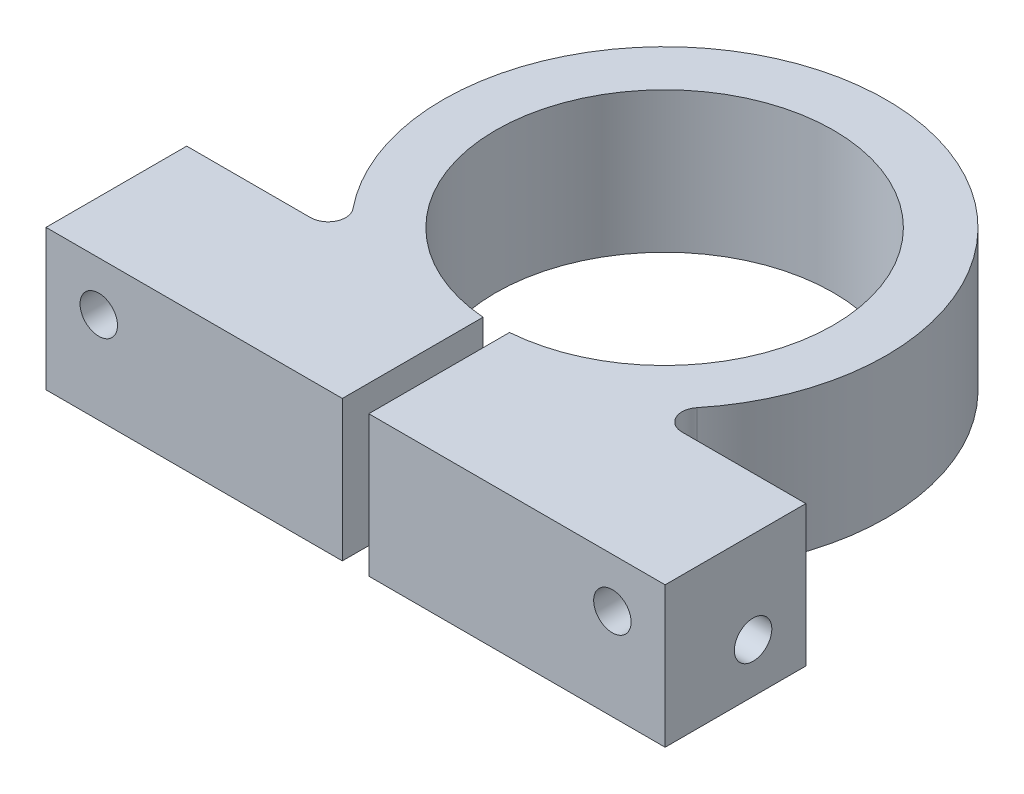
from build123d import *

# Parameters (mm, degrees)
EXTRUDE1_DEPTH          = 25.4
F_1_4_CLEARANCE_HOLE2_D = 6.7564
F_1_4_CLEARANCE_HOLE1_D = 6.7564
F_1_4_CLEARANCE_HOLE3_D = 6.7564


with BuildPart() as part:
    # Sketch1 → Extrude1 (new body)
    with BuildSketch(Plane(origin=(0, 0, 0), x_dir=(1, 0, 0), z_dir=(0, 1, 0))):
        with BuildLine():
            Line((2.3876, -55.786341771), (55.88, -55.786341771))
            Line((55.88, -55.786341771), (55.88, -30.386341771))
            Line((55.88, -30.386341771), (33.526933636, -30.386341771))
            ThreePointArc((33.526933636, -30.386341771), (30.660466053, -28.576621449), (31.061717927, -25.210507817))
            ThreePointArc((31.061717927, -25.210507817), (0, 40.005), (-31.061717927, -25.210507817))
            ThreePointArc((-31.061717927, -25.210507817), (-30.660466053, -28.576621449), (-33.526933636, -30.386341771))
            Line((-33.526933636, -30.386341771), (-55.88, -30.386341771))
            Line((-55.88, -30.386341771), (-55.88, -55.786341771))
            Line((-55.88, -55.786341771), (-2.3876, -55.786341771))
            Line((-2.3876, -55.786341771), (-2.3876, -30.386341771))
            ThreePointArc((-2.3876, -30.386341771), (0, 30.48), (2.3876, -30.386341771))
            Line((2.3876, -30.386341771), (2.3876, -55.786341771))
        make_face()
    extrude(amount=EXTRUDE1_DEPTH)

    # 1_4 Clearance Hole2 (through all)
    with Locations(Plane(origin=(-55.88, 8.89, 39.911341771), x_dir=(0, 0, -1), z_dir=(-1, 0, 0))):
        with Locations((0, 0)):
            Hole(F_1_4_CLEARANCE_HOLE2_D / 2)

    # 1_4 Clearance Hole1 (through all)
    with Locations(Plane(origin=(-46.355, 16.51, 30.386341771), x_dir=(-1, 0, 0), z_dir=(0, 0, -1))):
        with Locations((0, 0)):
            Hole(F_1_4_CLEARANCE_HOLE1_D / 2)

    # 1_4 Clearance Hole3 (through all)
    with Locations(Plane(origin=(46.355, 16.51, 30.386341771), x_dir=(-1, 0, 0), z_dir=(0, 0, -1))):
        with Locations((0, 0)):
            Hole(F_1_4_CLEARANCE_HOLE3_D / 2)


solid = part.part
